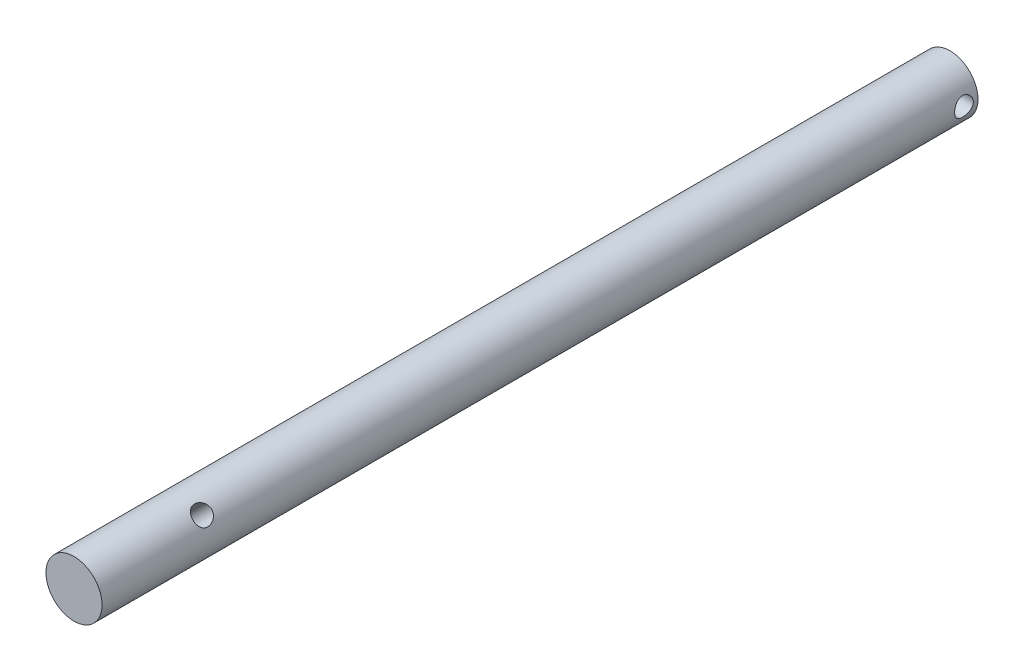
ISO-10303-21;
HEADER;
FILE_DESCRIPTION(('STEP AP214'),'2;1');
FILE_NAME('part.step','',(''),(''),'','','');
FILE_SCHEMA(('AUTOMOTIVE_DESIGN { 1 0 10303 214 1 1 1 1 }'));
ENDSEC;
DATA;
#1=APPLICATION_CONTEXT('core data for automotive mechanical design processes');
#2=APPLICATION_PROTOCOL_DEFINITION('international standard','automotive_design',2000,#1);
#3=PRODUCT_CONTEXT('',#1,'mechanical');
#4=PRODUCT('Part','Part','',(#3));
#5=PRODUCT_RELATED_PRODUCT_CATEGORY('part','',(#4));
#6=PRODUCT_DEFINITION_FORMATION('','',#4);
#7=PRODUCT_DEFINITION_CONTEXT('part definition',#1,'design');
#8=PRODUCT_DEFINITION('design','',#6,#7);
#9=PRODUCT_DEFINITION_SHAPE('','',#8);
#10=(LENGTH_UNIT() NAMED_UNIT(*) SI_UNIT(.MILLI.,.METRE.));
#11=(NAMED_UNIT(*) PLANE_ANGLE_UNIT() SI_UNIT($,.RADIAN.));
#12=(NAMED_UNIT(*) SI_UNIT($,.STERADIAN.) SOLID_ANGLE_UNIT());
#13=UNCERTAINTY_MEASURE_WITH_UNIT(LENGTH_MEASURE(1.E-05),#10,'distance_accuracy_value','');
#14=(GEOMETRIC_REPRESENTATION_CONTEXT(3) GLOBAL_UNCERTAINTY_ASSIGNED_CONTEXT((#13)) GLOBAL_UNIT_ASSIGNED_CONTEXT((#10,
#11,#12)) REPRESENTATION_CONTEXT('',''));
#15=CARTESIAN_POINT('',(0.,0.,0.));
#16=DIRECTION('',(0.,0.,1.));
#17=DIRECTION('',(1.,0.,0.));
#18=AXIS2_PLACEMENT_3D('',#15,#16,#17);
#19=CARTESIAN_POINT('',(0.,0.,0.));
#20=DIRECTION('',(0.,0.,1.));
#21=DIRECTION('',(1.,0.,0.));
#22=AXIS2_PLACEMENT_3D('',#19,#20,#21);
#23=PLANE('',#22);
#24=CARTESIAN_POINT('',(0.,0.,0.));
#25=DIRECTION('',(0.,0.,1.));
#26=DIRECTION('',(1.,0.,0.));
#27=AXIS2_PLACEMENT_3D('',#24,#25,#26);
#28=CIRCLE('',#27,15.);
#29=CARTESIAN_POINT('',(15.,0.,0.));
#30=VERTEX_POINT('',#29);
#31=EDGE_CURVE('E48',#30,#30,#28,.T.);
#32=ORIENTED_EDGE('',*,*,#31,.F.);
#33=EDGE_LOOP('',(#32));
#34=FACE_BOUND('',#33,.T.);
#35=ADVANCED_FACE('F33',(#34),#23,.F.);
#36=CARTESIAN_POINT('',(0.,0.,480.));
#37=DIRECTION('',(0.,0.,1.));
#38=DIRECTION('',(1.,0.,0.));
#39=AXIS2_PLACEMENT_3D('',#36,#37,#38);
#40=CYLINDRICAL_SURFACE('',#39,15.);
#41=CARTESIAN_POINT('',(13.5355339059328,6.46446609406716,410.41));
#42=CARTESIAN_POINT('',(13.5355341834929,6.46446454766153,410.68234087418));
#43=CARTESIAN_POINT('',(13.5253704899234,6.48587652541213,410.954673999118));
#44=CARTESIAN_POINT('',(13.4846213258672,6.5701696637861,411.491272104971));
#45=CARTESIAN_POINT('',(13.4540324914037,6.63305765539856,411.755535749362));
#46=CARTESIAN_POINT('',(13.3722290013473,6.7964507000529,412.268134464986));
#47=CARTESIAN_POINT('',(13.321054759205,6.89688202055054,412.516499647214));
#48=CARTESIAN_POINT('',(13.1976278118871,7.13021585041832,412.99180024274));
#49=CARTESIAN_POINT('',(13.1253704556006,7.26312552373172,413.218730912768));
#50=CARTESIAN_POINT('',(12.9563035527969,7.5607171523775,413.653599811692));
#51=CARTESIAN_POINT('',(12.8587130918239,7.7263599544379,413.860577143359));
#52=CARTESIAN_POINT('',(12.6399803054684,8.0792287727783,414.241034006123));
#53=CARTESIAN_POINT('',(12.5188342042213,8.26645824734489,414.414508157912));
#54=CARTESIAN_POINT('',(12.2497169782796,8.66041108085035,414.727394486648));
#55=CARTESIAN_POINT('',(12.1011284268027,8.86751560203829,414.86579985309));
#56=CARTESIAN_POINT('',(11.7808483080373,9.28878323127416,415.097957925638));
#57=CARTESIAN_POINT('',(11.6091629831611,9.50294442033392,415.191722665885));
#58=CARTESIAN_POINT('',(11.2522594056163,9.92269488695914,415.328679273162));
#59=CARTESIAN_POINT('',(11.0677198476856,10.1283231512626,415.373517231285));
#60=CARTESIAN_POINT('',(10.6848570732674,10.5314299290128,415.416581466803));
#61=CARTESIAN_POINT('',(10.4865374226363,10.7289105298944,415.414819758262));
#62=CARTESIAN_POINT('',(10.0902613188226,11.1021559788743,415.36577872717));
#63=CARTESIAN_POINT('',(9.89259569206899,11.2784687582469,415.320287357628));
#64=CARTESIAN_POINT('',(9.49653682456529,11.613921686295,415.188035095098));
#65=CARTESIAN_POINT('',(9.29814353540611,11.773060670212,415.101271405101));
#66=CARTESIAN_POINT('',(8.90461064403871,12.0735271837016,414.88789341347));
#67=CARTESIAN_POINT('',(8.70954808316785,12.2145931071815,414.760770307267));
#68=CARTESIAN_POINT('',(8.3320499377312,12.4751605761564,414.470701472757));
#69=CARTESIAN_POINT('',(8.14961788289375,12.5946561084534,414.307745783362));
#70=CARTESIAN_POINT('',(7.79571456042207,12.8168859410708,413.941628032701));
#71=CARTESIAN_POINT('',(7.6251637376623,12.9185662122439,413.736934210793));
#72=CARTESIAN_POINT('',(7.31217741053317,13.0982714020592,413.297756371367));
#73=CARTESIAN_POINT('',(7.16974623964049,13.1762926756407,413.06326777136));
#74=CARTESIAN_POINT('',(6.91804211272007,13.3101987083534,412.566731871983));
#75=CARTESIAN_POINT('',(6.80927082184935,13.365752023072,412.304339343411));
#76=CARTESIAN_POINT('',(6.63398147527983,13.4536246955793,411.762143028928));
#77=CARTESIAN_POINT('',(6.56744571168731,13.4859537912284,411.482346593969));
#78=CARTESIAN_POINT('',(6.48287900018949,13.5268029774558,410.926808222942));
#79=CARTESIAN_POINT('',(6.46279514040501,13.5363314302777,410.651452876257));
#80=CARTESIAN_POINT('',(6.46635462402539,13.5346324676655,410.101119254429));
#81=CARTESIAN_POINT('',(6.48999002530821,13.5234088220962,409.82614091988));
#82=CARTESIAN_POINT('',(6.57789805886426,13.4808558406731,409.29421517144));
#83=CARTESIAN_POINT('',(6.6407468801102,13.4502303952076,409.036972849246));
#84=CARTESIAN_POINT('',(6.8022670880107,13.3692657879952,408.537281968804));
#85=CARTESIAN_POINT('',(6.90094482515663,13.3189231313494,408.294836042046));
#86=CARTESIAN_POINT('',(7.13291998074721,13.1961791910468,407.823097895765));
#87=CARTESIAN_POINT('',(7.26721618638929,13.1231289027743,407.594466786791));
#88=CARTESIAN_POINT('',(7.56276178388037,12.9550564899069,407.164269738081));
#89=CARTESIAN_POINT('',(7.724019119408,12.86002788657,406.962711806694));
#90=CARTESIAN_POINT('',(8.07536690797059,12.6425109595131,406.582360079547));
#91=CARTESIAN_POINT('',(8.2664713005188,12.5189214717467,406.405128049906));
#92=CARTESIAN_POINT('',(8.66361803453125,12.2474281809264,406.09041928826));
#93=CARTESIAN_POINT('',(8.8696598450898,12.0995252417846,405.952941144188));
#94=CARTESIAN_POINT('',(9.28736743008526,11.7818977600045,405.722899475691));
#95=CARTESIAN_POINT('',(9.49898674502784,11.6123247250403,405.63004361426));
#96=CARTESIAN_POINT('',(9.92115942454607,11.2537620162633,405.491361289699));
#97=CARTESIAN_POINT('',(10.1317131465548,11.0647793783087,405.445517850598));
#98=CARTESIAN_POINT('',(10.5344884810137,10.6816751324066,405.403689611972));
#99=CARTESIAN_POINT('',(10.7271065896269,10.4882125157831,405.405462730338));
#100=CARTESIAN_POINT('',(11.0988650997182,10.0939875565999,405.453286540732));
#101=CARTESIAN_POINT('',(11.2780065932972,9.89322580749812,405.499333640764));
#102=CARTESIAN_POINT('',(11.6158243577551,9.494206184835,405.63291117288));
#103=CARTESIAN_POINT('',(11.774780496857,9.29595919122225,405.719771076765));
#104=CARTESIAN_POINT('',(12.0729642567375,8.90527895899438,405.931887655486));
#105=CARTESIAN_POINT('',(12.2121883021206,8.7128467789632,406.057151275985));
#106=CARTESIAN_POINT('',(12.4743984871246,8.33334064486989,406.34784756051));
#107=CARTESIAN_POINT('',(12.5965945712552,8.14672739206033,406.514593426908));
#108=CARTESIAN_POINT('',(12.8181167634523,7.79355014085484,406.881286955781));
#109=CARTESIAN_POINT('',(12.9174355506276,7.62699256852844,407.081245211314));
#110=CARTESIAN_POINT('',(13.0969420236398,7.31463424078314,407.518046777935));
#111=CARTESIAN_POINT('',(13.1762286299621,7.1699012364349,407.756027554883));
#112=CARTESIAN_POINT('',(13.3109891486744,6.91652110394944,408.256672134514));
#113=CARTESIAN_POINT('',(13.3664692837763,6.80786454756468,408.519329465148));
#114=CARTESIAN_POINT('',(13.4522015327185,6.63679646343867,409.049809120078));
#115=CARTESIAN_POINT('',(13.4834806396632,6.57251658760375,409.316861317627));
#116=CARTESIAN_POINT('',(13.5251430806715,6.48635950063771,409.859280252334));
#117=CARTESIAN_POINT('',(13.5355336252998,6.46446765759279,410.134644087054));
#118=CARTESIAN_POINT('',(13.5355339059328,6.46446609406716,410.41));
#119=B_SPLINE_CURVE_WITH_KNOTS('',3,(#41,#42,#43,#44,#45,#46,#47,#48,#49,#50,#51,#52,#53,#54,
#55,#56,#57,#58,#59,#60,#61,#62,#63,#64,#65,#66,#67,#68,#69,#70,#71,#72,#73,#74,#75,#76,#77,#78,
#79,#80,#81,#82,#83,#84,#85,#86,#87,#88,#89,#90,#91,#92,#93,#94,#95,#96,#97,#98,#99,#100,#101,
#102,#103,#104,#105,#106,#107,#108,#109,#110,#111,#112,#113,#114,#115,#116,#117,#118),
.UNSPECIFIED.,.T.,.F.,(4,2,2,2,2,2,2,2,2,2,2,2,2,2,2,2,2,2,2,2,2,2,2,2,2,2,2,2,2,2,2,2,2,2,2,2,
2,2,4),(0.,0.816002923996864,1.63214027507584,2.44668313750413,3.26140583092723,
4.10506687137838,4.94886325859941,5.81467530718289,6.6802538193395,7.51571593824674,
8.35096266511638,9.15345024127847,9.95599220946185,10.7690827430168,11.5823995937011,
12.4340087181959,13.2857489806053,14.1496319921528,15.0131525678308,15.837714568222,
16.6621267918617,17.4582197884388,18.2544539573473,19.0759428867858,19.8976742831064,
20.7589404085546,21.6201759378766,22.4756895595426,23.3308941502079,24.1459042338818,
24.9608482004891,25.7628478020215,26.5649925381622,27.3967759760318,28.2288252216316,
29.0934451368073,29.9578389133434,30.7831606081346,31.6081973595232),.UNSPECIFIED.);
#120=CARTESIAN_POINT('',(13.5355339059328,6.46446609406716,410.41));
#121=VERTEX_POINT('',#120);
#122=EDGE_CURVE('E36',#121,#121,#119,.T.);
#123=ORIENTED_EDGE('',*,*,#122,.T.);
#124=EDGE_LOOP('',(#123));
#125=FACE_BOUND('',#124,.T.);
#126=CARTESIAN_POINT('',(-6.46446609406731,-13.5355339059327,410.41));
#127=CARTESIAN_POINT('',(-6.46446454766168,-13.5355341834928,410.13765912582));
#128=CARTESIAN_POINT('',(-6.48587652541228,-13.5253704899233,409.865326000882));
#129=CARTESIAN_POINT('',(-6.57016966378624,-13.4846213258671,409.328727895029));
#130=CARTESIAN_POINT('',(-6.63305765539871,-13.4540324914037,409.064464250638));
#131=CARTESIAN_POINT('',(-6.79645070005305,-13.3722290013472,408.551865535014));
#132=CARTESIAN_POINT('',(-6.89688202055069,-13.3210547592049,408.303500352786));
#133=CARTESIAN_POINT('',(-7.13021585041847,-13.1976278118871,407.82819975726));
#134=CARTESIAN_POINT('',(-7.26312552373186,-13.1253704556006,407.601269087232));
#135=CARTESIAN_POINT('',(-7.56071715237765,-12.9563035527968,407.166400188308));
#136=CARTESIAN_POINT('',(-7.72635995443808,-12.8587130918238,406.959422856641));
#137=CARTESIAN_POINT('',(-8.07922877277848,-12.6399803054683,406.578965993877));
#138=CARTESIAN_POINT('',(-8.26645824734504,-12.5188342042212,406.405491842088));
#139=CARTESIAN_POINT('',(-8.66041108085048,-12.2497169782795,406.092605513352));
#140=CARTESIAN_POINT('',(-8.86751560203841,-12.1011284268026,405.95420014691));
#141=CARTESIAN_POINT('',(-9.28878323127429,-11.7808483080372,405.722042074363));
#142=CARTESIAN_POINT('',(-9.50294442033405,-11.609162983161,405.628277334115));
#143=CARTESIAN_POINT('',(-9.92269488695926,-11.2522594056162,405.491320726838));
#144=CARTESIAN_POINT('',(-10.1283231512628,-11.0677198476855,405.446482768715));
#145=CARTESIAN_POINT('',(-10.5314299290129,-10.6848570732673,405.403418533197));
#146=CARTESIAN_POINT('',(-10.7289105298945,-10.4865374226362,405.405180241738));
#147=CARTESIAN_POINT('',(-11.1021559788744,-10.0902613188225,405.45422127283));
#148=CARTESIAN_POINT('',(-11.278468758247,-9.89259569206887,405.499712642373));
#149=CARTESIAN_POINT('',(-11.6139216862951,-9.49653682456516,405.631964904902));
#150=CARTESIAN_POINT('',(-11.7730606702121,-9.29814353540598,405.718728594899));
#151=CARTESIAN_POINT('',(-12.0735271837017,-8.90461064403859,405.93210658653));
#152=CARTESIAN_POINT('',(-12.2145931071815,-8.70954808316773,406.059229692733));
#153=CARTESIAN_POINT('',(-12.4751605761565,-8.33204993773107,406.349298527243));
#154=CARTESIAN_POINT('',(-12.5946561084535,-8.14961788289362,406.512254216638));
#155=CARTESIAN_POINT('',(-12.8168859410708,-7.79571456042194,406.878371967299));
#156=CARTESIAN_POINT('',(-12.918566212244,-7.62516373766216,407.083065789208));
#157=CARTESIAN_POINT('',(-13.0982714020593,-7.31217741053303,407.522243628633));
#158=CARTESIAN_POINT('',(-13.1762926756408,-7.16974623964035,407.75673222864));
#159=CARTESIAN_POINT('',(-13.3101987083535,-6.91804211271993,408.253268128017));
#160=CARTESIAN_POINT('',(-13.365752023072,-6.80927082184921,408.515660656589));
#161=CARTESIAN_POINT('',(-13.4536246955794,-6.63398147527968,409.057856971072));
#162=CARTESIAN_POINT('',(-13.4859537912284,-6.56744571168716,409.337653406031));
#163=CARTESIAN_POINT('',(-13.5268029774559,-6.48287900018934,409.893191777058));
#164=CARTESIAN_POINT('',(-13.5363314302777,-6.46279514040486,410.168547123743));
#165=CARTESIAN_POINT('',(-13.5346324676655,-6.46635462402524,410.718880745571));
#166=CARTESIAN_POINT('',(-13.5234088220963,-6.48999002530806,410.99385908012));
#167=CARTESIAN_POINT('',(-13.4808558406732,-6.57789805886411,411.52578482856));
#168=CARTESIAN_POINT('',(-13.4502303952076,-6.64074688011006,411.783027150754));
#169=CARTESIAN_POINT('',(-13.3692657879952,-6.80226708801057,412.282718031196));
#170=CARTESIAN_POINT('',(-13.3189231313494,-6.90094482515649,412.525163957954));
#171=CARTESIAN_POINT('',(-13.1961791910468,-7.13291998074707,412.996902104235));
#172=CARTESIAN_POINT('',(-13.1231289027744,-7.26721618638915,413.225533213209));
#173=CARTESIAN_POINT('',(-12.955056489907,-7.56276178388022,413.655730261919));
#174=CARTESIAN_POINT('',(-12.8600278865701,-7.72401911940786,413.857288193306));
#175=CARTESIAN_POINT('',(-12.6425109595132,-8.07536690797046,414.237639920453));
#176=CARTESIAN_POINT('',(-12.5189214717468,-8.26647130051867,414.414871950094));
#177=CARTESIAN_POINT('',(-12.2474281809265,-8.66361803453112,414.72958071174));
#178=CARTESIAN_POINT('',(-12.0995252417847,-8.86965984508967,414.867058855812));
#179=CARTESIAN_POINT('',(-11.7818977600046,-9.28736743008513,415.097100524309));
#180=CARTESIAN_POINT('',(-11.6123247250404,-9.49898674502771,415.18995638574));
#181=CARTESIAN_POINT('',(-11.2537620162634,-9.92115942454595,415.328638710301));
#182=CARTESIAN_POINT('',(-11.0647793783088,-10.1317131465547,415.374482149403));
#183=CARTESIAN_POINT('',(-10.6816751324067,-10.5344884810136,415.416310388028));
#184=CARTESIAN_POINT('',(-10.4882125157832,-10.7271065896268,415.414537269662));
#185=CARTESIAN_POINT('',(-10.0939875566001,-11.098865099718,415.366713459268));
#186=CARTESIAN_POINT('',(-9.89322580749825,-11.2780065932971,415.320666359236));
#187=CARTESIAN_POINT('',(-9.49420618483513,-11.615824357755,415.18708882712));
#188=CARTESIAN_POINT('',(-9.29595919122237,-11.7747804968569,415.100228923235));
#189=CARTESIAN_POINT('',(-8.90527895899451,-12.0729642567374,414.888112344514));
#190=CARTESIAN_POINT('',(-8.71284677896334,-12.2121883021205,414.762848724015));
#191=CARTESIAN_POINT('',(-8.33334064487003,-12.4743984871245,414.47215243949));
#192=CARTESIAN_POINT('',(-8.14672739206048,-12.5965945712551,414.305406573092));
#193=CARTESIAN_POINT('',(-7.79355014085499,-12.8181167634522,413.938713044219));
#194=CARTESIAN_POINT('',(-7.62699256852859,-12.9174355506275,413.738754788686));
#195=CARTESIAN_POINT('',(-7.31463424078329,-13.0969420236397,413.301953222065));
#196=CARTESIAN_POINT('',(-7.16990123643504,-13.176228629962,413.063972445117));
#197=CARTESIAN_POINT('',(-6.91652110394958,-13.3109891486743,412.563327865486));
#198=CARTESIAN_POINT('',(-6.80786454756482,-13.3664692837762,412.300670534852));
#199=CARTESIAN_POINT('',(-6.63679646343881,-13.4522015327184,411.770190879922));
#200=CARTESIAN_POINT('',(-6.5725165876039,-13.4834806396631,411.503138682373));
#201=CARTESIAN_POINT('',(-6.48635950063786,-13.5251430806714,410.960719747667));
#202=CARTESIAN_POINT('',(-6.46446765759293,-13.5355336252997,410.685355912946));
#203=CARTESIAN_POINT('',(-6.46446609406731,-13.5355339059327,410.41));
#204=B_SPLINE_CURVE_WITH_KNOTS('',3,(#126,#127,#128,#129,#130,#131,#132,#133,#134,#135,#136,
#137,#138,#139,#140,#141,#142,#143,#144,#145,#146,#147,#148,#149,#150,#151,#152,#153,#154,#155,
#156,#157,#158,#159,#160,#161,#162,#163,#164,#165,#166,#167,#168,#169,#170,#171,#172,#173,#174,
#175,#176,#177,#178,#179,#180,#181,#182,#183,#184,#185,#186,#187,#188,#189,#190,#191,#192,#193,
#194,#195,#196,#197,#198,#199,#200,#201,#202,#203),.UNSPECIFIED.,.T.,.F.,(4,2,2,2,2,2,2,2,2,2,2,
2,2,2,2,2,2,2,2,2,2,2,2,2,2,2,2,2,2,2,2,2,2,2,2,2,2,2,4),(0.,0.816002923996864,1.63214027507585,
2.44668313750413,3.26140583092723,4.10506687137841,4.9488632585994,5.81467530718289,
6.6802538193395,7.51571593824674,8.35096266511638,9.15345024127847,9.95599220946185,
10.7690827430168,11.5823995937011,12.4340087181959,13.2857489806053,14.1496319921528,
15.0131525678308,15.837714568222,16.6621267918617,17.4582197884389,18.2544539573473,
19.0759428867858,19.8976742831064,20.7589404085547,21.6201759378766,22.4756895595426,
23.3308941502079,24.1459042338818,24.9608482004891,25.7628478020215,26.5649925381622,
27.3967759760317,28.2288252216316,29.0934451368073,29.9578389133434,30.7831606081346,
31.6081973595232),.UNSPECIFIED.);
#205=CARTESIAN_POINT('',(-6.46446609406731,-13.5355339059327,410.41));
#206=VERTEX_POINT('',#205);
#207=EDGE_CURVE('E56',#206,#206,#204,.T.);
#208=ORIENTED_EDGE('',*,*,#207,.T.);
#209=EDGE_LOOP('',(#208));
#210=FACE_BOUND('',#209,.T.);
#211=CARTESIAN_POINT('',(-15.,0.,2.5));
#212=CARTESIAN_POINT('',(-15.0000007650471,0.272816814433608,2.49999873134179));
#213=CARTESIAN_POINT('',(-14.9924884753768,0.545625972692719,2.52240133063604));
#214=CARTESIAN_POINT('',(-14.9632605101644,1.08320880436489,2.61114554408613));
#215=CARTESIAN_POINT('',(-14.9415433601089,1.3479816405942,2.67749171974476));
#216=CARTESIAN_POINT('',(-14.8862653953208,1.86166394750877,2.85159621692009));
#217=CARTESIAN_POINT('',(-14.8527243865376,2.11059912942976,2.9592853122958));
#218=CARTESIAN_POINT('',(-14.7772222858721,2.58687468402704,3.2127058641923));
#219=CARTESIAN_POINT('',(-14.7352595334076,2.81421078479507,3.3584448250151));
#220=CARTESIAN_POINT('',(-14.6457047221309,3.24870837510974,3.6891290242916));
#221=CARTESIAN_POINT('',(-14.5979778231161,3.45501850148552,3.87515617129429));
#222=CARTESIAN_POINT('',(-14.5030157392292,3.83416346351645,4.27883577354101));
#223=CARTESIAN_POINT('',(-14.4557806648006,4.00699092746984,4.49649517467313));
#224=CARTESIAN_POINT('',(-14.3656666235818,4.31912471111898,4.96492557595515));
#225=CARTESIAN_POINT('',(-14.3229519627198,4.45732429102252,5.21646869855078));
#226=CARTESIAN_POINT('',(-14.2487652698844,4.68909436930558,5.74088047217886));
#227=CARTESIAN_POINT('',(-14.2172898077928,4.78267848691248,6.01374258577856));
#228=CARTESIAN_POINT('',(-14.1705651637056,4.91936730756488,6.56336610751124));
#229=CARTESIAN_POINT('',(-14.1548047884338,4.96406724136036,6.83968604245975));
#230=CARTESIAN_POINT('',(-14.139782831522,5.00670561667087,7.39631877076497));
#231=CARTESIAN_POINT('',(-14.1405161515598,5.00465850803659,7.67663030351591));
#232=CARTESIAN_POINT('',(-14.1579507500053,4.95509951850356,8.21968315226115));
#233=CARTESIAN_POINT('',(-14.1739207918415,4.90966956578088,8.48264201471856));
#234=CARTESIAN_POINT('',(-14.2188328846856,4.77803081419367,8.99696709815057));
#235=CARTESIAN_POINT('',(-14.2477764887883,4.69181713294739,9.24833192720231));
#236=CARTESIAN_POINT('',(-14.3158955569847,4.47969529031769,9.73706374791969));
#237=CARTESIAN_POINT('',(-14.3552282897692,4.35317024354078,9.97414012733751));
#238=CARTESIAN_POINT('',(-14.4396279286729,4.06444553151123,10.4243545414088));
#239=CARTESIAN_POINT('',(-14.484696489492,3.9022355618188,10.6374856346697));
#240=CARTESIAN_POINT('',(-14.5783664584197,3.53674666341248,11.0454579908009));
#241=CARTESIAN_POINT('',(-14.6270294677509,3.33176575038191,11.2387634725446));
#242=CARTESIAN_POINT('',(-14.720346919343,2.89169784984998,11.5886563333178));
#243=CARTESIAN_POINT('',(-14.765000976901,2.65660797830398,11.7452401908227));
#244=CARTESIAN_POINT('',(-14.845855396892,2.15973806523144,12.0184815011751));
#245=CARTESIAN_POINT('',(-14.8819675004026,1.89771638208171,12.1347274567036));
#246=CARTESIAN_POINT('',(-14.9410283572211,1.35634541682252,12.3210158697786));
#247=CARTESIAN_POINT('',(-14.9639816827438,1.07700219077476,12.3910743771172));
#248=CARTESIAN_POINT('',(-14.9933813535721,0.521919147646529,12.4802783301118));
#249=CARTESIAN_POINT('',(-15.0005000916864,0.246547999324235,12.5014990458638));
#250=CARTESIAN_POINT('',(-14.9994451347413,-0.303875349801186,12.4983366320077));
#251=CARTESIAN_POINT('',(-14.9912740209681,-0.578927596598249,12.4739612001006));
#252=CARTESIAN_POINT('',(-14.9610012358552,-1.11259933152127,12.3819404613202));
#253=CARTESIAN_POINT('',(-14.9393099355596,-1.37146403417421,12.3155689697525));
#254=CARTESIAN_POINT('',(-14.8845923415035,-1.87427979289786,12.1430327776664));
#255=CARTESIAN_POINT('',(-14.8515646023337,-2.11822894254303,12.0368630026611));
#256=CARTESIAN_POINT('',(-14.7764465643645,-2.59144148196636,11.7846478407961));
#257=CARTESIAN_POINT('',(-14.7341407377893,-2.82014979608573,11.6376270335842));
#258=CARTESIAN_POINT('',(-14.6452626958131,-3.25032415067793,11.3090292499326));
#259=CARTESIAN_POINT('',(-14.5986891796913,-3.45178183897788,11.1274417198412));
#260=CARTESIAN_POINT('',(-14.5038423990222,-3.8312625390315,10.7251062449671));
#261=CARTESIAN_POINT('',(-14.4555880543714,-4.00780484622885,10.5029538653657));
#262=CARTESIAN_POINT('',(-14.3649986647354,-4.32128761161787,10.0311421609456));
#263=CARTESIAN_POINT('',(-14.3226636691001,-4.45822773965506,9.78148260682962));
#264=CARTESIAN_POINT('',(-14.2491195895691,-4.6879846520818,9.26163492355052));
#265=CARTESIAN_POINT('',(-14.2178880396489,-4.7808906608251,8.99148960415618));
#266=CARTESIAN_POINT('',(-14.1705416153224,-4.91947333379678,8.43810674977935));
#267=CARTESIAN_POINT('',(-14.1544199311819,-4.9651712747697,8.15487517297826));
#268=CARTESIAN_POINT('',(-14.1398929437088,-5.00638141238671,7.59901451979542));
#269=CARTESIAN_POINT('',(-14.1406200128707,-5.004351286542,7.32658829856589));
#270=CARTESIAN_POINT('',(-14.1575634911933,-4.95621146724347,6.78617462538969));
#271=CARTESIAN_POINT('',(-14.1737789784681,-4.91010439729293,6.51818691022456));
#272=CARTESIAN_POINT('',(-14.2192262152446,-4.77685906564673,5.99932168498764));
#273=CARTESIAN_POINT('',(-14.2482049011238,-4.69051673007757,5.74821587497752));
#274=CARTESIAN_POINT('',(-14.3158199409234,-4.47989682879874,5.26386296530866));
#275=CARTESIAN_POINT('',(-14.3544584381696,-4.35561084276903,5.03061984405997));
#276=CARTESIAN_POINT('',(-14.4391414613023,-4.06630346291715,4.57758165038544));
#277=CARTESIAN_POINT('',(-14.4854355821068,-3.8997412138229,4.35881749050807));
#278=CARTESIAN_POINT('',(-14.5791678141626,-3.53321441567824,3.951550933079));
#279=CARTESIAN_POINT('',(-14.6266062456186,-3.33324042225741,3.76305712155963));
#280=CARTESIAN_POINT('',(-14.7195015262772,-2.89620778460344,3.41427793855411));
#281=CARTESIAN_POINT('',(-14.7648090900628,-2.65800756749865,3.255378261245));
#282=CARTESIAN_POINT('',(-14.8462995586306,-2.15678678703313,2.98004785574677));
#283=CARTESIAN_POINT('',(-14.8824847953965,-1.89377259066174,2.86360627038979));
#284=CARTESIAN_POINT('',(-14.9402757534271,-1.36246823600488,2.68139183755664));
#285=CARTESIAN_POINT('',(-14.9624606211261,-1.09493878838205,2.61358766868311));
#286=CARTESIAN_POINT('',(-14.9923203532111,-0.551602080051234,2.52289859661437));
#287=CARTESIAN_POINT('',(-14.9999992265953,-0.275797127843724,2.50000128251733));
#288=CARTESIAN_POINT('',(-15.,0.,2.5));
#289=B_SPLINE_CURVE_WITH_KNOTS('',3,(#211,#212,#213,#214,#215,#216,#217,#218,#219,#220,#221,
#222,#223,#224,#225,#226,#227,#228,#229,#230,#231,#232,#233,#234,#235,#236,#237,#238,#239,#240,
#241,#242,#243,#244,#245,#246,#247,#248,#249,#250,#251,#252,#253,#254,#255,#256,#257,#258,#259,
#260,#261,#262,#263,#264,#265,#266,#267,#268,#269,#270,#271,#272,#273,#274,#275,#276,#277,#278,
#279,#280,#281,#282,#283,#284,#285,#286,#287,#288),.UNSPECIFIED.,.T.,.F.,(4,2,2,2,2,2,2,2,2,2,2,
2,2,2,2,2,2,2,2,2,2,2,2,2,2,2,2,2,2,2,2,2,2,2,2,2,2,2,4),(0.,0.817435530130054,1.6349559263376,
2.45111336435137,3.2674318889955,4.1092342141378,4.95122166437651,5.8174192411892,
6.68335223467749,7.52009628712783,8.3565816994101,9.15484132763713,9.9531965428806,
10.764408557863,11.5758551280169,12.4296652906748,13.2835572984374,14.1459202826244,
15.0079834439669,15.832679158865,16.6572356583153,17.4579078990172,18.2586822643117,
19.0805199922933,19.9026090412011,20.7620511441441,21.6215004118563,22.479200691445,
23.3365142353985,24.1497833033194,24.9630039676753,25.7607793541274,26.5587319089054,
27.3915033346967,28.2245105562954,29.0899830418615,29.9552340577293,30.7818279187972,
31.6081933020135),.UNSPECIFIED.);
#290=CARTESIAN_POINT('',(-15.,0.,2.5));
#291=VERTEX_POINT('',#290);
#292=EDGE_CURVE('E10',#291,#291,#289,.T.);
#293=ORIENTED_EDGE('',*,*,#292,.T.);
#294=EDGE_LOOP('',(#293));
#295=FACE_BOUND('',#294,.T.);
#296=CARTESIAN_POINT('',(15.,0.,2.50000000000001));
#297=CARTESIAN_POINT('',(15.0000007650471,-0.272816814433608,2.49999873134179));
#298=CARTESIAN_POINT('',(14.9924884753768,-0.54562597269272,2.52240133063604));
#299=CARTESIAN_POINT('',(14.9632605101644,-1.08320880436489,2.61114554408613));
#300=CARTESIAN_POINT('',(14.9415433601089,-1.3479816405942,2.67749171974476));
#301=CARTESIAN_POINT('',(14.8862653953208,-1.86166394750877,2.85159621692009));
#302=CARTESIAN_POINT('',(14.8527243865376,-2.11059912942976,2.9592853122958));
#303=CARTESIAN_POINT('',(14.7772222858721,-2.58687468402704,3.2127058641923));
#304=CARTESIAN_POINT('',(14.7352595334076,-2.81421078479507,3.3584448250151));
#305=CARTESIAN_POINT('',(14.6457047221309,-3.24870837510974,3.6891290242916));
#306=CARTESIAN_POINT('',(14.5979778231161,-3.45501850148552,3.87515617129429));
#307=CARTESIAN_POINT('',(14.5030157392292,-3.83416346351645,4.27883577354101));
#308=CARTESIAN_POINT('',(14.4557806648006,-4.00699092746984,4.49649517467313));
#309=CARTESIAN_POINT('',(14.3656666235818,-4.31912471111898,4.96492557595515));
#310=CARTESIAN_POINT('',(14.3229519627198,-4.45732429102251,5.21646869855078));
#311=CARTESIAN_POINT('',(14.2487652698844,-4.68909436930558,5.74088047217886));
#312=CARTESIAN_POINT('',(14.2172898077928,-4.78267848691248,6.01374258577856));
#313=CARTESIAN_POINT('',(14.1705651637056,-4.91936730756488,6.56336610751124));
#314=CARTESIAN_POINT('',(14.1548047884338,-4.96406724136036,6.83968604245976));
#315=CARTESIAN_POINT('',(14.139782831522,-5.00670561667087,7.39631877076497));
#316=CARTESIAN_POINT('',(14.1405161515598,-5.00465850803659,7.67663030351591));
#317=CARTESIAN_POINT('',(14.1579507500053,-4.95509951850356,8.21968315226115));
#318=CARTESIAN_POINT('',(14.1739207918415,-4.90966956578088,8.48264201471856));
#319=CARTESIAN_POINT('',(14.2188328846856,-4.77803081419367,8.99696709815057));
#320=CARTESIAN_POINT('',(14.2477764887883,-4.69181713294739,9.24833192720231));
#321=CARTESIAN_POINT('',(14.3158955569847,-4.47969529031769,9.73706374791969));
#322=CARTESIAN_POINT('',(14.3552282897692,-4.35317024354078,9.97414012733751));
#323=CARTESIAN_POINT('',(14.4396279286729,-4.06444553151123,10.4243545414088));
#324=CARTESIAN_POINT('',(14.484696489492,-3.9022355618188,10.6374856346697));
#325=CARTESIAN_POINT('',(14.5783664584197,-3.53674666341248,11.0454579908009));
#326=CARTESIAN_POINT('',(14.6270294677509,-3.3317657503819,11.2387634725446));
#327=CARTESIAN_POINT('',(14.720346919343,-2.89169784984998,11.5886563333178));
#328=CARTESIAN_POINT('',(14.765000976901,-2.65660797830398,11.7452401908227));
#329=CARTESIAN_POINT('',(14.845855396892,-2.15973806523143,12.0184815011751));
#330=CARTESIAN_POINT('',(14.8819675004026,-1.89771638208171,12.1347274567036));
#331=CARTESIAN_POINT('',(14.9410283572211,-1.35634541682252,12.3210158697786));
#332=CARTESIAN_POINT('',(14.9639816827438,-1.07700219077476,12.3910743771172));
#333=CARTESIAN_POINT('',(14.9933813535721,-0.521919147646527,12.4802783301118));
#334=CARTESIAN_POINT('',(15.0005000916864,-0.246547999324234,12.5014990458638));
#335=CARTESIAN_POINT('',(14.9994451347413,0.303875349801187,12.4983366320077));
#336=CARTESIAN_POINT('',(14.9912740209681,0.578927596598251,12.4739612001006));
#337=CARTESIAN_POINT('',(14.9610012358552,1.11259933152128,12.3819404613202));
#338=CARTESIAN_POINT('',(14.9393099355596,1.37146403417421,12.3155689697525));
#339=CARTESIAN_POINT('',(14.8845923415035,1.87427979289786,12.1430327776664));
#340=CARTESIAN_POINT('',(14.8515646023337,2.11822894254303,12.0368630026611));
#341=CARTESIAN_POINT('',(14.7764465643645,2.59144148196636,11.7846478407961));
#342=CARTESIAN_POINT('',(14.7341407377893,2.82014979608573,11.6376270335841));
#343=CARTESIAN_POINT('',(14.6452626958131,3.25032415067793,11.3090292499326));
#344=CARTESIAN_POINT('',(14.5986891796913,3.45178183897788,11.1274417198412));
#345=CARTESIAN_POINT('',(14.5038423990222,3.8312625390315,10.7251062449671));
#346=CARTESIAN_POINT('',(14.4555880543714,4.00780484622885,10.5029538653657));
#347=CARTESIAN_POINT('',(14.3649986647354,4.32128761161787,10.0311421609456));
#348=CARTESIAN_POINT('',(14.3226636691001,4.45822773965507,9.78148260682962));
#349=CARTESIAN_POINT('',(14.2491195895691,4.68798465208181,9.26163492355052));
#350=CARTESIAN_POINT('',(14.2178880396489,4.7808906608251,8.99148960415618));
#351=CARTESIAN_POINT('',(14.1705416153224,4.91947333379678,8.43810674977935));
#352=CARTESIAN_POINT('',(14.1544199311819,4.9651712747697,8.15487517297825));
#353=CARTESIAN_POINT('',(14.1398929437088,5.00638141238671,7.59901451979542));
#354=CARTESIAN_POINT('',(14.1406200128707,5.004351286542,7.32658829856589));
#355=CARTESIAN_POINT('',(14.1575634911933,4.95621146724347,6.78617462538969));
#356=CARTESIAN_POINT('',(14.1737789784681,4.91010439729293,6.51818691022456));
#357=CARTESIAN_POINT('',(14.2192262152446,4.77685906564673,5.99932168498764));
#358=CARTESIAN_POINT('',(14.2482049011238,4.69051673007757,5.74821587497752));
#359=CARTESIAN_POINT('',(14.3158199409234,4.47989682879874,5.26386296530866));
#360=CARTESIAN_POINT('',(14.3544584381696,4.35561084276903,5.03061984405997));
#361=CARTESIAN_POINT('',(14.4391414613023,4.06630346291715,4.57758165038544));
#362=CARTESIAN_POINT('',(14.4854355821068,3.8997412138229,4.35881749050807));
#363=CARTESIAN_POINT('',(14.5791678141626,3.53321441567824,3.951550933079));
#364=CARTESIAN_POINT('',(14.6266062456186,3.33324042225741,3.76305712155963));
#365=CARTESIAN_POINT('',(14.7195015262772,2.89620778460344,3.41427793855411));
#366=CARTESIAN_POINT('',(14.7648090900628,2.65800756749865,3.255378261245));
#367=CARTESIAN_POINT('',(14.8462995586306,2.15678678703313,2.98004785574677));
#368=CARTESIAN_POINT('',(14.8824847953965,1.89377259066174,2.86360627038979));
#369=CARTESIAN_POINT('',(14.9402757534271,1.36246823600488,2.68139183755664));
#370=CARTESIAN_POINT('',(14.9624606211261,1.09493878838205,2.61358766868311));
#371=CARTESIAN_POINT('',(14.9923203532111,0.551602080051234,2.52289859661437));
#372=CARTESIAN_POINT('',(14.9999992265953,0.275797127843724,2.50000128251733));
#373=CARTESIAN_POINT('',(15.,0.,2.50000000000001));
#374=B_SPLINE_CURVE_WITH_KNOTS('',3,(#296,#297,#298,#299,#300,#301,#302,#303,#304,#305,#306,
#307,#308,#309,#310,#311,#312,#313,#314,#315,#316,#317,#318,#319,#320,#321,#322,#323,#324,#325,
#326,#327,#328,#329,#330,#331,#332,#333,#334,#335,#336,#337,#338,#339,#340,#341,#342,#343,#344,
#345,#346,#347,#348,#349,#350,#351,#352,#353,#354,#355,#356,#357,#358,#359,#360,#361,#362,#363,
#364,#365,#366,#367,#368,#369,#370,#371,#372,#373),.UNSPECIFIED.,.T.,.F.,(4,2,2,2,2,2,2,2,2,2,2,
2,2,2,2,2,2,2,2,2,2,2,2,2,2,2,2,2,2,2,2,2,2,2,2,2,2,2,4),(0.,0.817435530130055,1.6349559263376,
2.45111336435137,3.2674318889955,4.1092342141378,4.95122166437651,5.8174192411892,
6.6833522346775,7.52009628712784,8.3565816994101,9.15484132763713,9.9531965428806,
10.764408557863,11.5758551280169,12.4296652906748,13.2835572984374,14.1459202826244,
15.0079834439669,15.832679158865,16.6572356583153,17.4579078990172,18.2586822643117,
19.0805199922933,19.9026090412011,20.7620511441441,21.6215004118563,22.479200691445,
23.3365142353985,24.1497833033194,24.9630039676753,25.7607793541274,26.5587319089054,
27.3915033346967,28.2245105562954,29.0899830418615,29.9552340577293,30.7818279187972,
31.6081933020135),.UNSPECIFIED.);
#375=CARTESIAN_POINT('',(15.,0.,2.50000000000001));
#376=VERTEX_POINT('',#375);
#377=EDGE_CURVE('E43',#376,#376,#374,.T.);
#378=ORIENTED_EDGE('',*,*,#377,.T.);
#379=EDGE_LOOP('',(#378));
#380=FACE_BOUND('',#379,.T.);
#381=CARTESIAN_POINT('',(0.,0.,468.41));
#382=DIRECTION('',(0.,0.,1.));
#383=DIRECTION('',(1.,0.,0.));
#384=AXIS2_PLACEMENT_3D('',#381,#382,#383);
#385=CIRCLE('',#384,14.9999999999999);
#386=CARTESIAN_POINT('',(14.9999999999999,0.,468.41));
#387=VERTEX_POINT('',#386);
#388=EDGE_CURVE('E84',#387,#387,#385,.T.);
#389=ORIENTED_EDGE('',*,*,#388,.F.);
#390=EDGE_LOOP('',(#389));
#391=FACE_BOUND('',#390,.T.);
#392=ORIENTED_EDGE('',*,*,#31,.T.);
#393=EDGE_LOOP('',(#392));
#394=FACE_BOUND('',#393,.T.);
#395=ADVANCED_FACE('F59',(#125,#210,#295,#380,#391,#394),#40,.T.);
#396=CARTESIAN_POINT('',(0.,14.9999999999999,468.41));
#397=DIRECTION('',(0.,0.,-1.));
#398=DIRECTION('',(-1.,0.,0.));
#399=AXIS2_PLACEMENT_3D('',#396,#397,#398);
#400=PLANE('',#399);
#401=ORIENTED_EDGE('',*,*,#388,.T.);
#402=EDGE_LOOP('',(#401));
#403=FACE_BOUND('',#402,.T.);
#404=ADVANCED_FACE('F66',(#403),#400,.F.);
#405=CARTESIAN_POINT('',(-15.,0.,7.5));
#406=DIRECTION('',(1.,0.,0.));
#407=DIRECTION('',(0.,0.,-1.));
#408=AXIS2_PLACEMENT_3D('',#405,#406,#407);
#409=CYLINDRICAL_SURFACE('',#408,5.);
#410=ORIENTED_EDGE('',*,*,#292,.F.);
#411=EDGE_LOOP('',(#410));
#412=FACE_BOUND('',#411,.T.);
#413=ORIENTED_EDGE('',*,*,#377,.F.);
#414=EDGE_LOOP('',(#413));
#415=FACE_BOUND('',#414,.T.);
#416=ADVANCED_FACE('F62',(#412,#415),#409,.F.);
#417=CARTESIAN_POINT('',(15.0000000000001,14.9999999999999,410.41));
#418=DIRECTION('',(-0.707106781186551,-0.707106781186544,0.));
#419=DIRECTION('',(0.707106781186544,-0.707106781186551,0.));
#420=AXIS2_PLACEMENT_3D('',#417,#418,#419);
#421=CYLINDRICAL_SURFACE('',#420,5.);
#422=ORIENTED_EDGE('',*,*,#207,.F.);
#423=EDGE_LOOP('',(#422));
#424=FACE_BOUND('',#423,.T.);
#425=ORIENTED_EDGE('',*,*,#122,.F.);
#426=EDGE_LOOP('',(#425));
#427=FACE_BOUND('',#426,.T.);
#428=ADVANCED_FACE('F65',(#424,#427),#421,.F.);
#429=CLOSED_SHELL('',(#35,#395,#404,#416,#428));
#430=MANIFOLD_SOLID_BREP('B2',#429);
#431=ADVANCED_BREP_SHAPE_REPRESENTATION('',(#18,#430),#14);
#432=SHAPE_DEFINITION_REPRESENTATION(#9,#431);
ENDSEC;
END-ISO-10303-21;
